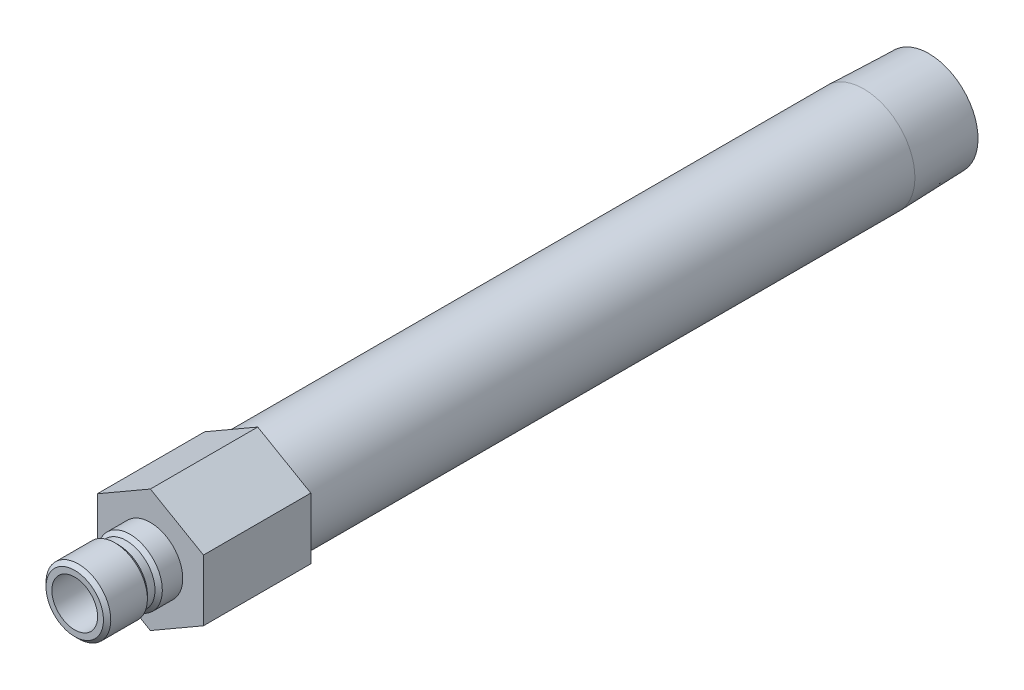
from build123d import *

# Parameters (mm, degrees)
SKETCH2_R           = 4.7625
BOSS_EXTRUDE1_DEPTH = 22.352


with BuildPart() as part:
    # Sketch1 → Revolve1 (revolve)
    with BuildSketch(Plane(origin=(0, 0, 0), x_dir=(0, 0, -1), z_dir=(1, 0, 0))):
        Polygon((-15.748, 4.7625), (-15.748, 5.9817), (-14.986, 6.7437), (-7.366, 6.7437), (-6.604, 5.9817), (-5.0165, 5.9817), (-4.2545, 6.7437), (0, 6.7437), (0, 10.668), (148.4884, 10.668), (162.052, 10.244140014), (162.052, 7.8994), (22.352, 7.8994), (22.352, 4.7625), align=None)
    revolve(axis=Axis((0, 0, 0), (0, 0, 1)))

    # Sketch2 → Boss-Extrude1 (add)
    with BuildSketch(Plane.XY):
        Polygon((-11.049, 6.379143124), (-11.049, -6.379143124), (0, -12.758286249), (11.049, -6.379143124), (11.049, 6.379143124), (0, 12.758286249), align=None)
        with Locations(Location((0, 0, 0), (0, 0, 90))):
            Circle(SKETCH2_R, mode=Mode.SUBTRACT)
    extrude(amount=-BOSS_EXTRUDE1_DEPTH)


solid = part.part
